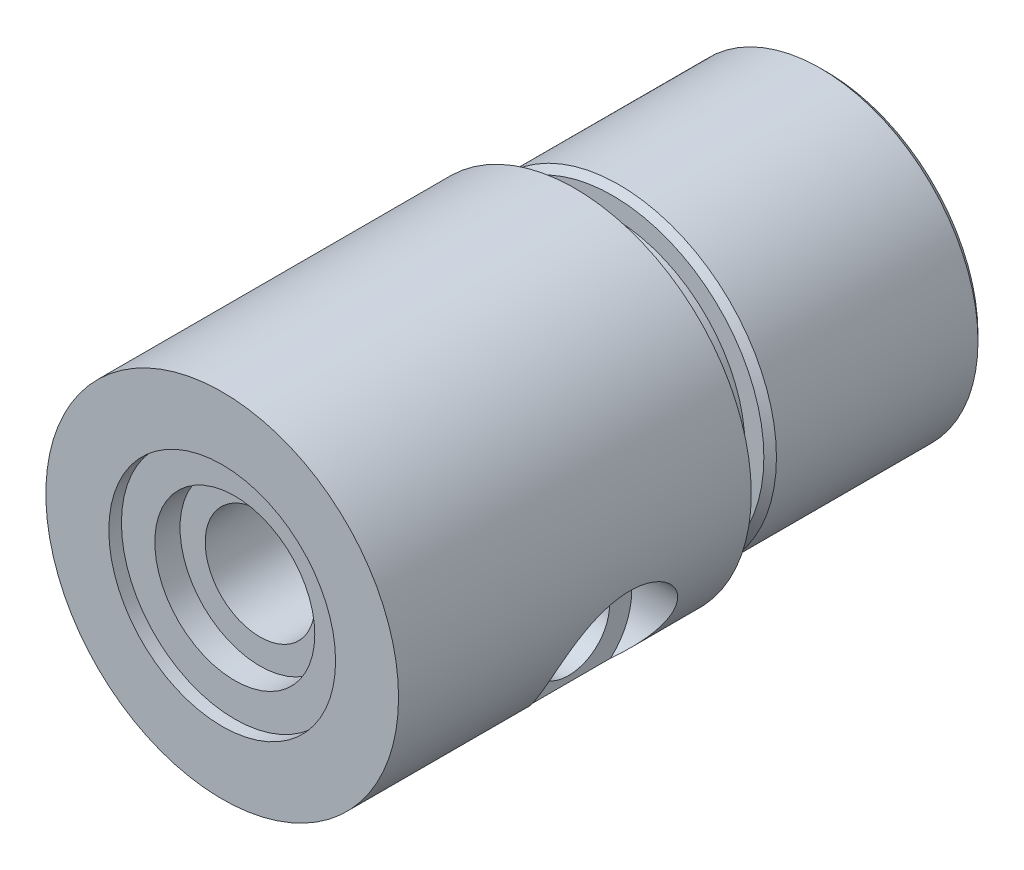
ISO-10303-21;
HEADER;
FILE_DESCRIPTION(('STEP AP214'),'2;1');
FILE_NAME('part.step','',(''),(''),'','','');
FILE_SCHEMA(('AUTOMOTIVE_DESIGN { 1 0 10303 214 1 1 1 1 }'));
ENDSEC;
DATA;
#1=APPLICATION_CONTEXT('core data for automotive mechanical design processes');
#2=APPLICATION_PROTOCOL_DEFINITION('international standard','automotive_design',2000,#1);
#3=PRODUCT_CONTEXT('',#1,'mechanical');
#4=PRODUCT('Part','Part','',(#3));
#5=PRODUCT_RELATED_PRODUCT_CATEGORY('part','',(#4));
#6=PRODUCT_DEFINITION_FORMATION('','',#4);
#7=PRODUCT_DEFINITION_CONTEXT('part definition',#1,'design');
#8=PRODUCT_DEFINITION('design','',#6,#7);
#9=PRODUCT_DEFINITION_SHAPE('','',#8);
#10=(LENGTH_UNIT() NAMED_UNIT(*) SI_UNIT(.MILLI.,.METRE.));
#11=(NAMED_UNIT(*) PLANE_ANGLE_UNIT() SI_UNIT($,.RADIAN.));
#12=(NAMED_UNIT(*) SI_UNIT($,.STERADIAN.) SOLID_ANGLE_UNIT());
#13=UNCERTAINTY_MEASURE_WITH_UNIT(LENGTH_MEASURE(1.E-05),#10,'distance_accuracy_value','');
#14=(GEOMETRIC_REPRESENTATION_CONTEXT(3) GLOBAL_UNCERTAINTY_ASSIGNED_CONTEXT((#13)) GLOBAL_UNIT_ASSIGNED_CONTEXT((#10,
#11,#12)) REPRESENTATION_CONTEXT('',''));
#15=CARTESIAN_POINT('',(0.,0.,0.));
#16=DIRECTION('',(0.,0.,1.));
#17=DIRECTION('',(1.,0.,0.));
#18=AXIS2_PLACEMENT_3D('',#15,#16,#17);
#19=CARTESIAN_POINT('',(0.,0.,48.));
#20=DIRECTION('',(0.,0.,-1.));
#21=DIRECTION('',(-1.,0.,0.));
#22=AXIS2_PLACEMENT_3D('',#19,#20,#21);
#23=CYLINDRICAL_SURFACE('',#22,14.);
#24=CARTESIAN_POINT('',(0.,0.,20.));
#25=DIRECTION('',(0.,0.,1.));
#26=DIRECTION('',(1.,0.,0.));
#27=AXIS2_PLACEMENT_3D('',#24,#25,#26);
#28=CIRCLE('',#27,14.);
#29=CARTESIAN_POINT('',(14.,0.,20.));
#30=VERTEX_POINT('',#29);
#31=EDGE_CURVE('E117',#30,#30,#28,.T.);
#32=ORIENTED_EDGE('',*,*,#31,.T.);
#33=EDGE_LOOP('',(#32));
#34=FACE_BOUND('',#33,.T.);
#35=CARTESIAN_POINT('',(0.,0.,48.));
#36=DIRECTION('',(0.,0.,1.));
#37=DIRECTION('',(1.,0.,0.));
#38=AXIS2_PLACEMENT_3D('',#35,#36,#37);
#39=CIRCLE('',#38,14.);
#40=CARTESIAN_POINT('',(14.,0.,48.));
#41=VERTEX_POINT('',#40);
#42=EDGE_CURVE('E122',#41,#41,#39,.T.);
#43=ORIENTED_EDGE('',*,*,#42,.F.);
#44=EDGE_LOOP('',(#43));
#45=FACE_BOUND('',#44,.T.);
#46=DIRECTION('',(0.,0.,-1.));
#47=VECTOR('',#46,1.);
#48=CARTESIAN_POINT('',(9.,-10.7238052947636,48.));
#49=LINE('',#48,#47);
#50=CARTESIAN_POINT('',(9.,-10.7238052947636,32.8366561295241));
#51=VERTEX_POINT('',#50);
#52=CARTESIAN_POINT('',(9.,-10.7238052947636,26.1633438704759));
#53=VERTEX_POINT('',#52);
#54=EDGE_CURVE('E105',#51,#53,#49,.T.);
#55=ORIENTED_EDGE('',*,*,#54,.F.);
#56=CARTESIAN_POINT('',(9.,-10.7238052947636,32.8366561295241));
#57=CARTESIAN_POINT('',(9.06564268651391,-10.6687159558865,32.8981304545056));
#58=CARTESIAN_POINT('',(9.13163062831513,-10.6123062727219,32.9580293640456));
#59=CARTESIAN_POINT('',(9.2640771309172,-10.4968845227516,33.0747088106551));
#60=CARTESIAN_POINT('',(9.33053566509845,-10.4378726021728,33.1314895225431));
#61=CARTESIAN_POINT('',(9.53032590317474,-10.2569566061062,33.2972358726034));
#62=CARTESIAN_POINT('',(9.66404503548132,-10.131195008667,33.4015804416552));
#63=CARTESIAN_POINT('',(9.93183958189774,-9.86883768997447,33.5983951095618));
#64=CARTESIAN_POINT('',(10.0659112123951,-9.73217396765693,33.6907794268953));
#65=CARTESIAN_POINT('',(10.332155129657,-9.44903792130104,33.8622927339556));
#66=CARTESIAN_POINT('',(10.464327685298,-9.30256700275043,33.9414236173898));
#67=CARTESIAN_POINT('',(10.7135434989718,-9.01404038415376,34.0789498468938));
#68=CARTESIAN_POINT('',(10.8308624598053,-8.87281203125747,34.1385813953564));
#69=CARTESIAN_POINT('',(11.0619813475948,-8.58294318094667,34.2453280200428));
#70=CARTESIAN_POINT('',(11.175781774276,-8.43430374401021,34.2924448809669));
#71=CARTESIAN_POINT('',(11.3986805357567,-8.13052802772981,34.3730420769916));
#72=CARTESIAN_POINT('',(11.5077896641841,-7.97540848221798,34.406555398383));
#73=CARTESIAN_POINT('',(11.720660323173,-7.65914015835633,34.4589527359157));
#74=CARTESIAN_POINT('',(11.8244228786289,-7.49799254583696,34.4778395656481));
#75=CARTESIAN_POINT('',(12.0075174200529,-7.20030035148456,34.4977937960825));
#76=CARTESIAN_POINT('',(12.087880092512,-7.06456108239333,34.5014609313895));
#77=CARTESIAN_POINT('',(12.2438933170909,-6.79057524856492,34.4974897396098));
#78=CARTESIAN_POINT('',(12.3195448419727,-6.65232920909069,34.4898537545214));
#79=CARTESIAN_POINT('',(12.4656853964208,-6.37427288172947,34.4626583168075));
#80=CARTESIAN_POINT('',(12.5361744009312,-6.23446258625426,34.4430988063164));
#81=CARTESIAN_POINT('',(12.6715839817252,-5.95442240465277,34.3915268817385));
#82=CARTESIAN_POINT('',(12.7365044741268,-5.81419251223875,34.3595142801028));
#83=CARTESIAN_POINT('',(12.8608332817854,-5.53377209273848,34.2824102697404));
#84=CARTESIAN_POINT('',(12.9202051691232,-5.39358713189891,34.237239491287));
#85=CARTESIAN_POINT('',(13.032764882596,-5.11561576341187,34.1336908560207));
#86=CARTESIAN_POINT('',(13.085952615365,-4.97782939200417,34.0753127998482));
#87=CARTESIAN_POINT('',(13.1860456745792,-4.70628677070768,33.9453937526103));
#88=CARTESIAN_POINT('',(13.232952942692,-4.57252928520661,33.873856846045));
#89=CARTESIAN_POINT('',(13.3205681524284,-4.3106299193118,33.7178798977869));
#90=CARTESIAN_POINT('',(13.3612767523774,-4.18248744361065,33.6334412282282));
#91=CARTESIAN_POINT('',(13.4326487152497,-3.94682687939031,33.4619477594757));
#92=CARTESIAN_POINT('',(13.4639217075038,-3.83857362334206,33.3761533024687));
#93=CARTESIAN_POINT('',(13.5219489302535,-3.62887479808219,33.1952250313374));
#94=CARTESIAN_POINT('',(13.5487033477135,-3.52742894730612,33.1000916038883));
#95=CARTESIAN_POINT('',(13.5979964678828,-3.3323588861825,32.9011490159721));
#96=CARTESIAN_POINT('',(13.6205359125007,-3.23873330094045,32.7973413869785));
#97=CARTESIAN_POINT('',(13.661760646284,-3.06017886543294,32.5817844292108));
#98=CARTESIAN_POINT('',(13.6804459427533,-2.97524999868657,32.4700351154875));
#99=CARTESIAN_POINT('',(13.7137333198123,-2.8177588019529,32.2435732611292));
#100=CARTESIAN_POINT('',(13.7284578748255,-2.7448620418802,32.1291109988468));
#101=CARTESIAN_POINT('',(13.7550252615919,-2.60846913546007,31.8943458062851));
#102=CARTESIAN_POINT('',(13.7668671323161,-2.5449761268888,31.7740409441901));
#103=CARTESIAN_POINT('',(13.7879867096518,-2.42795357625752,31.5285166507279));
#104=CARTESIAN_POINT('',(13.7972653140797,-2.37442054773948,31.4032989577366));
#105=CARTESIAN_POINT('',(13.8135634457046,-2.27769028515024,31.1487382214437));
#106=CARTESIAN_POINT('',(13.8205821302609,-2.23449690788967,31.0193936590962));
#107=CARTESIAN_POINT('',(13.8326653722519,-2.15844091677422,30.7562788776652));
#108=CARTESIAN_POINT('',(13.8377107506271,-2.12568024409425,30.6224783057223));
#109=CARTESIAN_POINT('',(13.8459563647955,-2.07129188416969,30.3525266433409));
#110=CARTESIAN_POINT('',(13.8491559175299,-2.04966831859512,30.2163747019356));
#111=CARTESIAN_POINT('',(13.8538438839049,-2.01773897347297,29.9427638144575));
#112=CARTESIAN_POINT('',(13.8553328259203,-2.00742969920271,29.8053052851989));
#113=CARTESIAN_POINT('',(13.8566681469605,-1.99819161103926,29.5299477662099));
#114=CARTESIAN_POINT('',(13.8565139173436,-1.99926701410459,29.3920486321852));
#115=CARTESIAN_POINT('',(13.8545461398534,-2.01285842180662,29.1156475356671));
#116=CARTESIAN_POINT('',(13.852718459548,-2.02547186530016,28.9771504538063));
#117=CARTESIAN_POINT('',(13.847300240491,-2.06218810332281,28.7016701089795));
#118=CARTESIAN_POINT('',(13.843709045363,-2.08629517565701,28.5646874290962));
#119=CARTESIAN_POINT('',(13.8346094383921,-2.14580666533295,28.2933122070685));
#120=CARTESIAN_POINT('',(13.8291016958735,-2.1812071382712,28.1589187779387));
#121=CARTESIAN_POINT('',(13.8159451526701,-2.26304586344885,27.8935908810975));
#122=CARTESIAN_POINT('',(13.8082955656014,-2.30948816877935,27.762657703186));
#123=CARTESIAN_POINT('',(13.7905884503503,-2.41296893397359,27.5054261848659));
#124=CARTESIAN_POINT('',(13.7805344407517,-2.46999188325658,27.3791213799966));
#125=CARTESIAN_POINT('',(13.7576927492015,-2.59420037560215,27.1318542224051));
#126=CARTESIAN_POINT('',(13.7449040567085,-2.66138967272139,27.0108938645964));
#127=CARTESIAN_POINT('',(13.7019118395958,-2.87735524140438,26.6575060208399));
#128=CARTESIAN_POINT('',(13.6670623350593,-3.0406576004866,26.4342541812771));
#129=CARTESIAN_POINT('',(13.5826051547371,-3.39794694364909,26.0216411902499));
#130=CARTESIAN_POINT('',(13.5331643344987,-3.59157597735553,25.8319336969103));
#131=CARTESIAN_POINT('',(13.4170008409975,-4.00372500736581,25.4882335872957));
#132=CARTESIAN_POINT('',(13.3502808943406,-4.22224107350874,25.3342353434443));
#133=CARTESIAN_POINT('',(13.1986144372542,-4.67473364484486,25.0658149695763));
#134=CARTESIAN_POINT('',(13.1137697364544,-4.90861893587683,24.9511807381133));
#135=CARTESIAN_POINT('',(12.9255850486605,-5.38467997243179,24.7611733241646));
#136=CARTESIAN_POINT('',(12.8222416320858,-5.62685724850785,24.6858074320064));
#137=CARTESIAN_POINT('',(12.5930988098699,-6.12306264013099,24.5706166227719));
#138=CARTESIAN_POINT('',(12.4664874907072,-6.37712535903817,24.5325782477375));
#139=CARTESIAN_POINT('',(12.1966961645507,-6.8790947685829,24.4951205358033));
#140=CARTESIAN_POINT('',(12.053511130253,-7.1269995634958,24.4957129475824));
#141=CARTESIAN_POINT('',(11.7338854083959,-7.64327948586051,24.5339468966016));
#142=CARTESIAN_POINT('',(11.5555432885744,-7.91010461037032,24.576412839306));
#143=CARTESIAN_POINT('',(11.1855898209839,-8.42515985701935,24.7000826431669));
#144=CARTESIAN_POINT('',(10.9939637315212,-8.67336866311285,24.7813301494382));
#145=CARTESIAN_POINT('',(10.6804171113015,-9.05333979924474,24.9384660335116));
#146=CARTESIAN_POINT('',(10.5612303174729,-9.19201072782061,25.0035300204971));
#147=CARTESIAN_POINT('',(10.3206409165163,-9.46133893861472,25.1451233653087));
#148=CARTESIAN_POINT('',(10.1992386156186,-9.59199731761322,25.2216511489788));
#149=CARTESIAN_POINT('',(9.95530246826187,-9.84493849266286,25.385510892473));
#150=CARTESIAN_POINT('',(9.83276966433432,-9.96722827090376,25.4728336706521));
#151=CARTESIAN_POINT('',(9.58755260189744,-10.203321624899,25.657965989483));
#152=CARTESIAN_POINT('',(9.46486843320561,-10.3171288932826,25.7557709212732));
#153=CARTESIAN_POINT('',(9.28523210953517,-10.4780929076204,25.9072475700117));
#154=CARTESIAN_POINT('',(9.22786455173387,-10.5286390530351,25.9568729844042));
#155=CARTESIAN_POINT('',(9.11357857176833,-10.627718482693,26.0583903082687));
#156=CARTESIAN_POINT('',(9.05665968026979,-10.676254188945,26.1102793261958));
#157=CARTESIAN_POINT('',(8.99999999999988,-10.7238052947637,26.1633438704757));
#158=B_SPLINE_CURVE_WITH_KNOTS('',3,(#56,#57,#58,#59,#60,#61,#62,#63,#64,#65,#66,#67,#68,#69,
#70,#71,#72,#73,#74,#75,#76,#77,#78,#79,#80,#81,#82,#83,#84,#85,#86,#87,#88,#89,#90,#91,#92,#93,
#94,#95,#96,#97,#98,#99,#100,#101,#102,#103,#104,#105,#106,#107,#108,#109,#110,#111,#112,#113,
#114,#115,#116,#117,#118,#119,#120,#121,#122,#123,#124,#125,#126,#127,#128,#129,#130,#131,#132,
#133,#134,#135,#136,#137,#138,#139,#140,#141,#142,#143,#144,#145,#146,#147,#148,#149,#150,#151,
#152,#153,#154,#155,#156,#157),.UNSPECIFIED.,.F.,.F.,(4,2,2,2,2,2,2,2,2,2,2,2,2,2,2,2,2,2,2,2,2,
2,2,2,2,2,2,2,2,2,2,2,2,2,2,2,2,2,2,2,2,2,2,2,2,2,2,2,2,2,4),(0.,0.316349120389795,
0.632680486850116,1.2654734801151,1.90257947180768,2.53959435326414,3.11817894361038,
3.69668097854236,4.27377174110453,4.85075146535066,5.32365633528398,5.79646323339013,
6.26927242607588,6.74208873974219,7.21781831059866,7.69355506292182,8.16914439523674,
8.64468318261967,9.06902572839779,9.493350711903,9.91760093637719,10.3418503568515,
10.7508740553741,11.160033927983,11.5690503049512,11.9782190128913,12.3912711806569,
12.8044761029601,13.2175533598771,13.6307836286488,14.0475361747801,14.4644439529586,
14.8812062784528,15.2981218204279,15.7144309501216,16.1308941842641,16.9628044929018,
17.7855477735,18.6081613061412,19.426270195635,20.2445309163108,21.1002809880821,
21.9562913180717,22.9240013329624,23.8928029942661,24.4745970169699,25.0563112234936,
25.6375340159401,26.2185022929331,26.4919138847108,26.7649858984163),.UNSPECIFIED.);
#159=EDGE_CURVE('E167',#51,#53,#158,.T.);
#160=ORIENTED_EDGE('',*,*,#159,.T.);
#161=EDGE_LOOP('',(#55,#160));
#162=FACE_BOUND('',#161,.T.);
#163=CARTESIAN_POINT('',(-9.,-10.7238052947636,32.8366561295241));
#164=CARTESIAN_POINT('',(-9.06564268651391,-10.6687159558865,32.8981304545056));
#165=CARTESIAN_POINT('',(-9.13163062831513,-10.6123062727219,32.9580293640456));
#166=CARTESIAN_POINT('',(-9.2640771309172,-10.4968845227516,33.0747088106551));
#167=CARTESIAN_POINT('',(-9.33053566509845,-10.4378726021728,33.1314895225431));
#168=CARTESIAN_POINT('',(-9.53032590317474,-10.2569566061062,33.2972358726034));
#169=CARTESIAN_POINT('',(-9.66404503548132,-10.131195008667,33.4015804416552));
#170=CARTESIAN_POINT('',(-9.93183958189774,-9.86883768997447,33.5983951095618));
#171=CARTESIAN_POINT('',(-10.0659112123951,-9.73217396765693,33.6907794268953));
#172=CARTESIAN_POINT('',(-10.332155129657,-9.44903792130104,33.8622927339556));
#173=CARTESIAN_POINT('',(-10.464327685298,-9.30256700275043,33.9414236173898));
#174=CARTESIAN_POINT('',(-10.7135434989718,-9.01404038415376,34.0789498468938));
#175=CARTESIAN_POINT('',(-10.8308624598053,-8.87281203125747,34.1385813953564));
#176=CARTESIAN_POINT('',(-11.0619813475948,-8.58294318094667,34.2453280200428));
#177=CARTESIAN_POINT('',(-11.175781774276,-8.43430374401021,34.2924448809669));
#178=CARTESIAN_POINT('',(-11.3986805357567,-8.13052802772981,34.3730420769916));
#179=CARTESIAN_POINT('',(-11.5077896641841,-7.97540848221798,34.406555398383));
#180=CARTESIAN_POINT('',(-11.720660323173,-7.65914015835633,34.4589527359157));
#181=CARTESIAN_POINT('',(-11.8244228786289,-7.49799254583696,34.4778395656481));
#182=CARTESIAN_POINT('',(-12.0075174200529,-7.20030035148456,34.4977937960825));
#183=CARTESIAN_POINT('',(-12.087880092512,-7.06456108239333,34.5014609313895));
#184=CARTESIAN_POINT('',(-12.2438933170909,-6.79057524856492,34.4974897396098));
#185=CARTESIAN_POINT('',(-12.3195448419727,-6.65232920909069,34.4898537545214));
#186=CARTESIAN_POINT('',(-12.4656853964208,-6.37427288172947,34.4626583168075));
#187=CARTESIAN_POINT('',(-12.5361744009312,-6.23446258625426,34.4430988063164));
#188=CARTESIAN_POINT('',(-12.6715839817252,-5.95442240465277,34.3915268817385));
#189=CARTESIAN_POINT('',(-12.7365044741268,-5.81419251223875,34.3595142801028));
#190=CARTESIAN_POINT('',(-12.8608332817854,-5.53377209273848,34.2824102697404));
#191=CARTESIAN_POINT('',(-12.9202051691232,-5.39358713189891,34.237239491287));
#192=CARTESIAN_POINT('',(-13.032764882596,-5.11561576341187,34.1336908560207));
#193=CARTESIAN_POINT('',(-13.085952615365,-4.97782939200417,34.0753127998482));
#194=CARTESIAN_POINT('',(-13.1860456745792,-4.70628677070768,33.9453937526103));
#195=CARTESIAN_POINT('',(-13.232952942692,-4.57252928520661,33.873856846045));
#196=CARTESIAN_POINT('',(-13.3205681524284,-4.3106299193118,33.7178798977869));
#197=CARTESIAN_POINT('',(-13.3612767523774,-4.18248744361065,33.6334412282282));
#198=CARTESIAN_POINT('',(-13.4326487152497,-3.94682687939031,33.4619477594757));
#199=CARTESIAN_POINT('',(-13.4639217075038,-3.83857362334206,33.3761533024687));
#200=CARTESIAN_POINT('',(-13.5219489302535,-3.62887479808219,33.1952250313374));
#201=CARTESIAN_POINT('',(-13.5487033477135,-3.52742894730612,33.1000916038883));
#202=CARTESIAN_POINT('',(-13.5979964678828,-3.3323588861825,32.9011490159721));
#203=CARTESIAN_POINT('',(-13.6205359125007,-3.23873330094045,32.7973413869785));
#204=CARTESIAN_POINT('',(-13.661760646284,-3.06017886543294,32.5817844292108));
#205=CARTESIAN_POINT('',(-13.6804459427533,-2.97524999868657,32.4700351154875));
#206=CARTESIAN_POINT('',(-13.7137333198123,-2.8177588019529,32.2435732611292));
#207=CARTESIAN_POINT('',(-13.7284578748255,-2.7448620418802,32.1291109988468));
#208=CARTESIAN_POINT('',(-13.7550252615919,-2.60846913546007,31.8943458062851));
#209=CARTESIAN_POINT('',(-13.7668671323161,-2.5449761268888,31.7740409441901));
#210=CARTESIAN_POINT('',(-13.7879867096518,-2.42795357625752,31.5285166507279));
#211=CARTESIAN_POINT('',(-13.7972653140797,-2.37442054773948,31.4032989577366));
#212=CARTESIAN_POINT('',(-13.8135634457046,-2.27769028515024,31.1487382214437));
#213=CARTESIAN_POINT('',(-13.8205821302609,-2.23449690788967,31.0193936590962));
#214=CARTESIAN_POINT('',(-13.8326653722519,-2.15844091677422,30.7562788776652));
#215=CARTESIAN_POINT('',(-13.8377107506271,-2.12568024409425,30.6224783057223));
#216=CARTESIAN_POINT('',(-13.8459563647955,-2.07129188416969,30.3525266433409));
#217=CARTESIAN_POINT('',(-13.8491559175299,-2.04966831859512,30.2163747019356));
#218=CARTESIAN_POINT('',(-13.8538438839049,-2.01773897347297,29.9427638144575));
#219=CARTESIAN_POINT('',(-13.8553328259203,-2.00742969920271,29.8053052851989));
#220=CARTESIAN_POINT('',(-13.8566681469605,-1.99819161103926,29.5299477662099));
#221=CARTESIAN_POINT('',(-13.8565139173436,-1.99926701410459,29.3920486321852));
#222=CARTESIAN_POINT('',(-13.8545461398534,-2.01285842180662,29.1156475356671));
#223=CARTESIAN_POINT('',(-13.852718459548,-2.02547186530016,28.9771504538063));
#224=CARTESIAN_POINT('',(-13.847300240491,-2.06218810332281,28.7016701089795));
#225=CARTESIAN_POINT('',(-13.843709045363,-2.08629517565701,28.5646874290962));
#226=CARTESIAN_POINT('',(-13.8346094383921,-2.14580666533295,28.2933122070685));
#227=CARTESIAN_POINT('',(-13.8291016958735,-2.1812071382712,28.1589187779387));
#228=CARTESIAN_POINT('',(-13.8159451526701,-2.26304586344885,27.8935908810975));
#229=CARTESIAN_POINT('',(-13.8082955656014,-2.30948816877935,27.762657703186));
#230=CARTESIAN_POINT('',(-13.7905884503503,-2.41296893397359,27.5054261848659));
#231=CARTESIAN_POINT('',(-13.7805344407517,-2.46999188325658,27.3791213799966));
#232=CARTESIAN_POINT('',(-13.7576927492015,-2.59420037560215,27.1318542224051));
#233=CARTESIAN_POINT('',(-13.7449040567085,-2.66138967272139,27.0108938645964));
#234=CARTESIAN_POINT('',(-13.7019118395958,-2.87735524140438,26.6575060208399));
#235=CARTESIAN_POINT('',(-13.6670623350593,-3.0406576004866,26.4342541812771));
#236=CARTESIAN_POINT('',(-13.5826051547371,-3.39794694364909,26.0216411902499));
#237=CARTESIAN_POINT('',(-13.5331643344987,-3.59157597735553,25.8319336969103));
#238=CARTESIAN_POINT('',(-13.4170008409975,-4.00372500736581,25.4882335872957));
#239=CARTESIAN_POINT('',(-13.3502808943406,-4.22224107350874,25.3342353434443));
#240=CARTESIAN_POINT('',(-13.1986144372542,-4.67473364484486,25.0658149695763));
#241=CARTESIAN_POINT('',(-13.1137697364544,-4.90861893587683,24.9511807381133));
#242=CARTESIAN_POINT('',(-12.9255850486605,-5.38467997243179,24.7611733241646));
#243=CARTESIAN_POINT('',(-12.8222416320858,-5.62685724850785,24.6858074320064));
#244=CARTESIAN_POINT('',(-12.5930988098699,-6.12306264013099,24.5706166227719));
#245=CARTESIAN_POINT('',(-12.4664874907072,-6.37712535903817,24.5325782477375));
#246=CARTESIAN_POINT('',(-12.1966961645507,-6.8790947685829,24.4951205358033));
#247=CARTESIAN_POINT('',(-12.053511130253,-7.1269995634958,24.4957129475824));
#248=CARTESIAN_POINT('',(-11.7338854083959,-7.64327948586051,24.5339468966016));
#249=CARTESIAN_POINT('',(-11.5555432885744,-7.91010461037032,24.576412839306));
#250=CARTESIAN_POINT('',(-11.1855898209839,-8.42515985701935,24.7000826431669));
#251=CARTESIAN_POINT('',(-10.9939637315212,-8.67336866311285,24.7813301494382));
#252=CARTESIAN_POINT('',(-10.6804171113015,-9.05333979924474,24.9384660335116));
#253=CARTESIAN_POINT('',(-10.5612303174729,-9.19201072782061,25.0035300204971));
#254=CARTESIAN_POINT('',(-10.3206409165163,-9.46133893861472,25.1451233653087));
#255=CARTESIAN_POINT('',(-10.1992386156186,-9.59199731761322,25.2216511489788));
#256=CARTESIAN_POINT('',(-9.95530246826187,-9.84493849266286,25.385510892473));
#257=CARTESIAN_POINT('',(-9.83276966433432,-9.96722827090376,25.4728336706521));
#258=CARTESIAN_POINT('',(-9.58755260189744,-10.203321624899,25.657965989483));
#259=CARTESIAN_POINT('',(-9.46486843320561,-10.3171288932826,25.7557709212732));
#260=CARTESIAN_POINT('',(-9.28523210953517,-10.4780929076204,25.9072475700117));
#261=CARTESIAN_POINT('',(-9.22786455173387,-10.5286390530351,25.9568729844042));
#262=CARTESIAN_POINT('',(-9.11357857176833,-10.627718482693,26.0583903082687));
#263=CARTESIAN_POINT('',(-9.05665968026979,-10.676254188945,26.1102793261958));
#264=CARTESIAN_POINT('',(-8.99999999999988,-10.7238052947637,26.1633438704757));
#265=B_SPLINE_CURVE_WITH_KNOTS('',3,(#163,#164,#165,#166,#167,#168,#169,#170,#171,#172,#173,
#174,#175,#176,#177,#178,#179,#180,#181,#182,#183,#184,#185,#186,#187,#188,#189,#190,#191,#192,
#193,#194,#195,#196,#197,#198,#199,#200,#201,#202,#203,#204,#205,#206,#207,#208,#209,#210,#211,
#212,#213,#214,#215,#216,#217,#218,#219,#220,#221,#222,#223,#224,#225,#226,#227,#228,#229,#230,
#231,#232,#233,#234,#235,#236,#237,#238,#239,#240,#241,#242,#243,#244,#245,#246,#247,#248,#249,
#250,#251,#252,#253,#254,#255,#256,#257,#258,#259,#260,#261,#262,#263,#264),.UNSPECIFIED.,.F.,
.F.,(4,2,2,2,2,2,2,2,2,2,2,2,2,2,2,2,2,2,2,2,2,2,2,2,2,2,2,2,2,2,2,2,2,2,2,2,2,2,2,2,2,2,2,2,2,
2,2,2,2,2,4),(0.,0.316349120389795,0.632680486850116,1.2654734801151,1.90257947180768,
2.53959435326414,3.11817894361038,3.69668097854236,4.27377174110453,4.85075146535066,
5.32365633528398,5.79646323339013,6.26927242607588,6.74208873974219,7.21781831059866,
7.69355506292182,8.16914439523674,8.64468318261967,9.06902572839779,9.493350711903,
9.91760093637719,10.3418503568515,10.7508740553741,11.160033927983,11.5690503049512,
11.9782190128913,12.3912711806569,12.8044761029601,13.2175533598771,13.6307836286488,
14.0475361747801,14.4644439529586,14.8812062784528,15.2981218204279,15.7144309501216,
16.1308941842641,16.9628044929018,17.7855477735,18.6081613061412,19.426270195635,
20.2445309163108,21.1002809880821,21.9562913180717,22.9240013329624,23.8928029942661,
24.4745970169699,25.0563112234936,25.6375340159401,26.2185022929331,26.4919138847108,
26.7649858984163),.UNSPECIFIED.);
#266=CARTESIAN_POINT('',(-9.,-10.7238052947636,32.8366561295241));
#267=VERTEX_POINT('',#266);
#268=CARTESIAN_POINT('',(-9.,-10.7238052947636,26.1633438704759));
#269=VERTEX_POINT('',#268);
#270=EDGE_CURVE('E11',#267,#269,#265,.T.);
#271=ORIENTED_EDGE('',*,*,#270,.F.);
#272=DIRECTION('',(0.,0.,-1.));
#273=VECTOR('',#272,1.);
#274=CARTESIAN_POINT('',(-9.,-10.7238052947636,48.));
#275=LINE('',#274,#273);
#276=EDGE_CURVE('E46',#267,#269,#275,.T.);
#277=ORIENTED_EDGE('',*,*,#276,.T.);
#278=EDGE_LOOP('',(#271,#277));
#279=FACE_BOUND('',#278,.T.);
#280=ADVANCED_FACE('F33',(#34,#45,#162,#279),#23,.T.);
#281=CARTESIAN_POINT('',(-14.,-7.,29.5));
#282=DIRECTION('',(1.,0.,0.));
#283=DIRECTION('',(0.,0.,-1.));
#284=AXIS2_PLACEMENT_3D('',#281,#282,#283);
#285=CYLINDRICAL_SURFACE('',#284,3.25);
#286=CARTESIAN_POINT('',(-9.,-7.,29.5));
#287=DIRECTION('',(1.,0.,0.));
#288=DIRECTION('',(0.,0.,-1.));
#289=AXIS2_PLACEMENT_3D('',#286,#287,#288);
#290=CIRCLE('',#289,3.25);
#291=CARTESIAN_POINT('',(-9.,-7.,26.25));
#292=VERTEX_POINT('',#291);
#293=EDGE_CURVE('E100',#292,#292,#290,.F.);
#294=ORIENTED_EDGE('',*,*,#293,.T.);
#295=EDGE_LOOP('',(#294));
#296=FACE_BOUND('',#295,.T.);
#297=CARTESIAN_POINT('',(-0.5,-5.23092092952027,26.773672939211));
#298=CARTESIAN_POINT('',(-0.499999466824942,-5.19529760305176,26.796790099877));
#299=CARTESIAN_POINT('',(-0.496191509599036,-5.16010303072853,26.8206295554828));
#300=CARTESIAN_POINT('',(-0.481483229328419,-5.09161475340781,26.8689674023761));
#301=CARTESIAN_POINT('',(-0.470564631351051,-5.05832618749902,26.8934673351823));
#302=CARTESIAN_POINT('',(-0.442515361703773,-4.99573321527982,26.941307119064));
#303=CARTESIAN_POINT('',(-0.425627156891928,-4.96632747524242,26.9646565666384));
#304=CARTESIAN_POINT('',(-0.385711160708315,-4.91093749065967,27.0101015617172));
#305=CARTESIAN_POINT('',(-0.362695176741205,-4.88494680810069,27.0321994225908));
#306=CARTESIAN_POINT('',(-0.318376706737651,-4.84460087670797,27.0674613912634));
#307=CARTESIAN_POINT('',(-0.298654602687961,-4.8291017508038,27.081308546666));
#308=CARTESIAN_POINT('',(-0.256205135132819,-4.8007961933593,27.1070173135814));
#309=CARTESIAN_POINT('',(-0.233482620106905,-4.78798550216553,27.1188820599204));
#310=CARTESIAN_POINT('',(-0.190159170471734,-4.76801026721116,27.137613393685));
#311=CARTESIAN_POINT('',(-0.170073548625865,-4.76022689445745,27.1450058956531));
#312=CARTESIAN_POINT('',(-0.128403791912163,-4.74719824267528,27.1574659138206));
#313=CARTESIAN_POINT('',(-0.106820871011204,-4.74195093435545,27.1625352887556));
#314=CARTESIAN_POINT('',(-0.0625186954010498,-4.73433315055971,27.1699177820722));
#315=CARTESIAN_POINT('',(-0.0397925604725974,-4.7319830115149,27.1722114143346));
#316=CARTESIAN_POINT('',(0.00586669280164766,-4.73043449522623,27.173720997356));
#317=CARTESIAN_POINT('',(0.0287997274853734,-4.73123489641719,27.1729381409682));
#318=CARTESIAN_POINT('',(0.0715494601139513,-4.73565170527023,27.1686411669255));
#319=CARTESIAN_POINT('',(0.0914324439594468,-4.73895019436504,27.1654354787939));
#320=CARTESIAN_POINT('',(0.130227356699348,-4.74776760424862,27.1569279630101));
#321=CARTESIAN_POINT('',(0.149138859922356,-4.75328748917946,27.1516252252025));
#322=CARTESIAN_POINT('',(0.191629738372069,-4.76838601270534,27.1372602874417));
#323=CARTESIAN_POINT('',(0.21472295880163,-4.77870105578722,27.127536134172));
#324=CARTESIAN_POINT('',(0.258312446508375,-4.80209737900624,27.1058447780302));
#325=CARTESIAN_POINT('',(0.278803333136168,-4.81518424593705,27.0938730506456));
#326=CARTESIAN_POINT('',(0.323291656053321,-4.84819582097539,27.0642508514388));
#327=CARTESIAN_POINT('',(0.346274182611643,-4.86896218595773,27.0460172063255));
#328=CARTESIAN_POINT('',(0.387527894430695,-4.91351635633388,27.0080235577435));
#329=CARTESIAN_POINT('',(0.405795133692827,-4.93730666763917,26.9882622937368));
#330=CARTESIAN_POINT('',(0.437939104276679,-4.98777376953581,26.9476453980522));
#331=CARTESIAN_POINT('',(0.451725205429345,-5.01449705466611,26.9267760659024));
#332=CARTESIAN_POINT('',(0.474310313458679,-5.06990842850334,26.8849564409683));
#333=CARTESIAN_POINT('',(0.483108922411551,-5.09859667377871,26.8640061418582));
#334=CARTESIAN_POINT('',(0.496341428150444,-5.16151675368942,26.819672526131));
#335=CARTESIAN_POINT('',(0.499997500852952,-5.19596445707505,26.7963563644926));
#336=CARTESIAN_POINT('',(0.500002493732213,-5.26577023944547,26.7510590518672));
#337=CARTESIAN_POINT('',(0.496350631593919,-5.30112841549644,26.729078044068));
#338=CARTESIAN_POINT('',(0.48164793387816,-5.36933606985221,26.6884315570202));
#339=CARTESIAN_POINT('',(0.471049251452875,-5.40220985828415,26.6696467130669));
#340=CARTESIAN_POINT('',(0.442619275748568,-5.4660921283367,26.6345243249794));
#341=CARTESIAN_POINT('',(0.424797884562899,-5.49710309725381,26.6181834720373));
#342=CARTESIAN_POINT('',(0.385264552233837,-5.55110683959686,26.5907063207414));
#343=CARTESIAN_POINT('',(0.364530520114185,-5.57460550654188,26.5791572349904));
#344=CARTESIAN_POINT('',(0.318366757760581,-5.61775076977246,26.5584936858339));
#345=CARTESIAN_POINT('',(0.292941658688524,-5.63740112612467,26.5493768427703));
#346=CARTESIAN_POINT('',(0.241855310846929,-5.66943191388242,26.5348089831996));
#347=CARTESIAN_POINT('',(0.216673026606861,-5.68243100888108,26.5290320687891));
#348=CARTESIAN_POINT('',(0.164139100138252,-5.7040632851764,26.5195321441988));
#349=CARTESIAN_POINT('',(0.13678859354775,-5.71269873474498,26.5158080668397));
#350=CARTESIAN_POINT('',(0.0829135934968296,-5.72471238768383,26.5106554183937));
#351=CARTESIAN_POINT('',(0.0564796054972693,-5.72843462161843,26.5090763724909));
#352=CARTESIAN_POINT('',(0.0033123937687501,-5.73161809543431,26.5077248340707));
#353=CARTESIAN_POINT('',(-0.0234207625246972,-5.73108027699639,26.5079519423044));
#354=CARTESIAN_POINT('',(-0.0756771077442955,-5.72583951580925,26.5101801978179));
#355=CARTESIAN_POINT('',(-0.101213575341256,-5.7212475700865,26.512134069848));
#356=CARTESIAN_POINT('',(-0.151096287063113,-5.70824078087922,26.5177344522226));
#357=CARTESIAN_POINT('',(-0.175442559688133,-5.69982602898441,26.5213809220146));
#358=CARTESIAN_POINT('',(-0.222514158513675,-5.67942005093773,26.5303715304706));
#359=CARTESIAN_POINT('',(-0.245222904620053,-5.66739728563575,26.5357306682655));
#360=CARTESIAN_POINT('',(-0.288227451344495,-5.6402759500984,26.5480732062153));
#361=CARTESIAN_POINT('',(-0.308523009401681,-5.62517707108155,26.5550567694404));
#362=CARTESIAN_POINT('',(-0.347116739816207,-5.59173942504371,26.5708946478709));
#363=CARTESIAN_POINT('',(-0.365288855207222,-5.57328790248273,26.5798173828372));
#364=CARTESIAN_POINT('',(-0.39826476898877,-5.53429838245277,26.5991910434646));
#365=CARTESIAN_POINT('',(-0.413067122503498,-5.51375949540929,26.6096426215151));
#366=CARTESIAN_POINT('',(-0.440258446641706,-5.46946499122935,26.6328345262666));
#367=CARTESIAN_POINT('',(-0.452341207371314,-5.44558404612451,26.6456932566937));
#368=CARTESIAN_POINT('',(-0.472383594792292,-5.39689417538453,26.6727527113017));
#369=CARTESIAN_POINT('',(-0.480344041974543,-5.37208543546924,26.6869531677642));
#370=CARTESIAN_POINT('',(-0.49093136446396,-5.32778396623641,26.7131200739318));
#371=CARTESIAN_POINT('',(-0.494354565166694,-5.30834864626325,26.7248720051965));
#372=CARTESIAN_POINT('',(-0.498889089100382,-5.26954080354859,26.7489032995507));
#373=CARTESIAN_POINT('',(-0.500000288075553,-5.2501682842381,26.7611826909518));
#374=CARTESIAN_POINT('',(-0.5,-5.23092092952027,26.773672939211));
#375=B_SPLINE_CURVE_WITH_KNOTS('',3,(#297,#298,#299,#300,#301,#302,#303,#304,#305,#306,#307,
#308,#309,#310,#311,#312,#313,#314,#315,#316,#317,#318,#319,#320,#321,#322,#323,#324,#325,#326,
#327,#328,#329,#330,#331,#332,#333,#334,#335,#336,#337,#338,#339,#340,#341,#342,#343,#344,#345,
#346,#347,#348,#349,#350,#351,#352,#353,#354,#355,#356,#357,#358,#359,#360,#361,#362,#363,#364,
#365,#366,#367,#368,#369,#370,#371,#372,#373,#374),.UNSPECIFIED.,.T.,.F.,(4,2,2,2,2,2,2,2,2,2,2,
2,2,2,2,2,2,2,2,2,2,2,2,2,2,2,2,2,2,2,2,2,2,2,2,2,2,2,4),(0.,0.127308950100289,
0.254946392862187,0.377903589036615,0.500625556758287,0.586298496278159,0.671834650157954,
0.739891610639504,0.807894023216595,0.876371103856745,0.944821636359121,1.00577754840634,
1.06675994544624,1.1476070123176,1.22861860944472,1.33587780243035,1.4432264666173,
1.55262775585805,1.66203777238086,1.78667394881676,1.91132346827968,2.02857248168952,
2.14566129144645,2.24527125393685,2.34478339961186,2.43109157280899,2.51735483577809,
2.59718508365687,2.67699768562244,2.7546906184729,2.8323816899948,2.91077271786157,
2.98917161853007,3.07099682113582,3.15285704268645,3.24157748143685,3.33028025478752,
3.3990618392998,3.46784712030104),.UNSPECIFIED.);
#376=CARTESIAN_POINT('',(-0.5,-5.23092092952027,26.773672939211));
#377=VERTEX_POINT('',#376);
#378=EDGE_CURVE('E121',#377,#377,#375,.T.);
#379=ORIENTED_EDGE('',*,*,#378,.T.);
#380=EDGE_LOOP('',(#379));
#381=FACE_BOUND('',#380,.T.);
#382=CARTESIAN_POINT('',(9.,-7.,29.5));
#383=DIRECTION('',(1.,0.,0.));
#384=DIRECTION('',(0.,0.,-1.));
#385=AXIS2_PLACEMENT_3D('',#382,#383,#384);
#386=CIRCLE('',#385,3.25);
#387=CARTESIAN_POINT('',(9.,-7.,26.25));
#388=VERTEX_POINT('',#387);
#389=EDGE_CURVE('E104',#388,#388,#386,.F.);
#390=ORIENTED_EDGE('',*,*,#389,.F.);
#391=EDGE_LOOP('',(#390));
#392=FACE_BOUND('',#391,.T.);
#393=ADVANCED_FACE('F141',(#296,#381,#392),#285,.F.);
#394=CARTESIAN_POINT('',(0.,0.,17.));
#395=DIRECTION('',(0.,0.,1.));
#396=DIRECTION('',(1.,0.,0.));
#397=AXIS2_PLACEMENT_3D('',#394,#395,#396);
#398=PLANE('',#397);
#399=CARTESIAN_POINT('',(0.,0.,17.));
#400=DIRECTION('',(0.,0.,1.));
#401=DIRECTION('',(1.,0.,0.));
#402=AXIS2_PLACEMENT_3D('',#399,#400,#401);
#403=CIRCLE('',#402,12.);
#404=CARTESIAN_POINT('',(12.,0.,17.));
#405=VERTEX_POINT('',#404);
#406=EDGE_CURVE('E440',#405,#405,#403,.T.);
#407=ORIENTED_EDGE('',*,*,#406,.T.);
#408=EDGE_LOOP('',(#407));
#409=FACE_BOUND('',#408,.T.);
#410=CARTESIAN_POINT('',(0.,0.,17.));
#411=DIRECTION('',(0.,0.,1.));
#412=DIRECTION('',(1.,0.,0.));
#413=AXIS2_PLACEMENT_3D('',#410,#411,#412);
#414=CIRCLE('',#413,10.5);
#415=CARTESIAN_POINT('',(10.5,0.,17.));
#416=VERTEX_POINT('',#415);
#417=EDGE_CURVE('E125',#416,#416,#414,.T.);
#418=ORIENTED_EDGE('',*,*,#417,.F.);
#419=EDGE_LOOP('',(#418));
#420=FACE_BOUND('',#419,.T.);
#421=ADVANCED_FACE('F248',(#409,#420),#398,.T.);
#422=CARTESIAN_POINT('',(0.,0.,17.));
#423=DIRECTION('',(0.,0.,-1.));
#424=DIRECTION('',(-1.,0.,0.));
#425=AXIS2_PLACEMENT_3D('',#422,#423,#424);
#426=CYLINDRICAL_SURFACE('',#425,12.5);
#427=CARTESIAN_POINT('',(0.,0.,16.5));
#428=DIRECTION('',(0.,0.,1.));
#429=DIRECTION('',(1.,0.,0.));
#430=AXIS2_PLACEMENT_3D('',#427,#428,#429);
#431=CIRCLE('',#430,12.5);
#432=CARTESIAN_POINT('',(12.5,0.,16.5));
#433=VERTEX_POINT('',#432);
#434=EDGE_CURVE('E175',#433,#433,#431,.F.);
#435=ORIENTED_EDGE('',*,*,#434,.T.);
#436=EDGE_LOOP('',(#435));
#437=FACE_BOUND('',#436,.T.);
#438=CARTESIAN_POINT('',(0.,0.,0.500000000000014));
#439=DIRECTION('',(0.,0.,1.));
#440=DIRECTION('',(1.,0.,0.));
#441=AXIS2_PLACEMENT_3D('',#438,#439,#440);
#442=CIRCLE('',#441,12.5);
#443=CARTESIAN_POINT('',(12.5,0.,0.500000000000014));
#444=VERTEX_POINT('',#443);
#445=EDGE_CURVE('E131',#444,#444,#442,.T.);
#446=ORIENTED_EDGE('',*,*,#445,.T.);
#447=EDGE_LOOP('',(#446));
#448=FACE_BOUND('',#447,.T.);
#449=ADVANCED_FACE('F401',(#437,#448),#426,.T.);
#450=CARTESIAN_POINT('',(0.,0.,0.));
#451=DIRECTION('',(0.,0.,1.));
#452=DIRECTION('',(1.,0.,0.));
#453=AXIS2_PLACEMENT_3D('',#450,#451,#452);
#454=PLANE('',#453);
#455=CARTESIAN_POINT('',(0.,0.,0.));
#456=DIRECTION('',(0.,0.,1.));
#457=DIRECTION('',(1.,0.,0.));
#458=AXIS2_PLACEMENT_3D('',#455,#456,#457);
#459=CIRCLE('',#458,12.);
#460=CARTESIAN_POINT('',(12.,0.,0.));
#461=VERTEX_POINT('',#460);
#462=EDGE_CURVE('E438',#461,#461,#459,.F.);
#463=ORIENTED_EDGE('',*,*,#462,.T.);
#464=EDGE_LOOP('',(#463));
#465=FACE_BOUND('',#464,.T.);
#466=CARTESIAN_POINT('',(0.,0.,0.));
#467=DIRECTION('',(0.,0.,-1.));
#468=DIRECTION('',(-1.,0.,0.));
#469=AXIS2_PLACEMENT_3D('',#466,#467,#468);
#470=CIRCLE('',#469,8.);
#471=CARTESIAN_POINT('',(-8.,0.,0.));
#472=VERTEX_POINT('',#471);
#473=EDGE_CURVE('E118',#472,#472,#470,.T.);
#474=ORIENTED_EDGE('',*,*,#473,.F.);
#475=EDGE_LOOP('',(#474));
#476=FACE_BOUND('',#475,.T.);
#477=ADVANCED_FACE('F394',(#465,#476),#454,.F.);
#478=CARTESIAN_POINT('',(0.,0.,20.));
#479=DIRECTION('',(0.,0.,-1.));
#480=DIRECTION('',(-1.,0.,0.));
#481=AXIS2_PLACEMENT_3D('',#478,#479,#480);
#482=CYLINDRICAL_SURFACE('',#481,10.5);
#483=CARTESIAN_POINT('',(0.,0.,20.));
#484=DIRECTION('',(0.,0.,1.));
#485=DIRECTION('',(1.,0.,0.));
#486=AXIS2_PLACEMENT_3D('',#483,#484,#485);
#487=CIRCLE('',#486,10.5);
#488=CARTESIAN_POINT('',(10.5,0.,20.));
#489=VERTEX_POINT('',#488);
#490=EDGE_CURVE('E128',#489,#489,#487,.T.);
#491=ORIENTED_EDGE('',*,*,#490,.F.);
#492=EDGE_LOOP('',(#491));
#493=FACE_BOUND('',#492,.T.);
#494=ORIENTED_EDGE('',*,*,#417,.T.);
#495=EDGE_LOOP('',(#494));
#496=FACE_BOUND('',#495,.T.);
#497=ADVANCED_FACE('F184',(#493,#496),#482,.T.);
#498=CARTESIAN_POINT('',(0.,0.,20.));
#499=DIRECTION('',(0.,0.,1.));
#500=DIRECTION('',(1.,0.,0.));
#501=AXIS2_PLACEMENT_3D('',#498,#499,#500);
#502=PLANE('',#501);
#503=ORIENTED_EDGE('',*,*,#31,.F.);
#504=EDGE_LOOP('',(#503));
#505=FACE_BOUND('',#504,.T.);
#506=ORIENTED_EDGE('',*,*,#490,.T.);
#507=EDGE_LOOP('',(#506));
#508=FACE_BOUND('',#507,.T.);
#509=ADVANCED_FACE('F182',(#505,#508),#502,.F.);
#510=CARTESIAN_POINT('',(0.,0.,48.));
#511=DIRECTION('',(0.,0.,1.));
#512=DIRECTION('',(1.,0.,0.));
#513=AXIS2_PLACEMENT_3D('',#510,#511,#512);
#514=PLANE('',#513);
#515=CARTESIAN_POINT('',(0.,0.,48.));
#516=DIRECTION('',(0.,0.,1.));
#517=DIRECTION('',(1.,0.,0.));
#518=AXIS2_PLACEMENT_3D('',#515,#516,#517);
#519=CIRCLE('',#518,9.);
#520=CARTESIAN_POINT('',(9.,0.,48.));
#521=VERTEX_POINT('',#520);
#522=EDGE_CURVE('E93',#521,#521,#519,.T.);
#523=ORIENTED_EDGE('',*,*,#522,.F.);
#524=EDGE_LOOP('',(#523));
#525=FACE_BOUND('',#524,.T.);
#526=ORIENTED_EDGE('',*,*,#42,.T.);
#527=EDGE_LOOP('',(#526));
#528=FACE_BOUND('',#527,.T.);
#529=ADVANCED_FACE('F232',(#525,#528),#514,.T.);
#530=CARTESIAN_POINT('',(0.,0.,20.));
#531=DIRECTION('',(0.,0.,-1.));
#532=DIRECTION('',(-1.,0.,0.));
#533=AXIS2_PLACEMENT_3D('',#530,#531,#532);
#534=CYLINDRICAL_SURFACE('',#533,8.);
#535=CARTESIAN_POINT('',(0.,0.,20.));
#536=DIRECTION('',(0.,0.,-1.));
#537=DIRECTION('',(-1.,0.,0.));
#538=AXIS2_PLACEMENT_3D('',#535,#536,#537);
#539=CIRCLE('',#538,8.);
#540=CARTESIAN_POINT('',(-8.,0.,20.));
#541=VERTEX_POINT('',#540);
#542=EDGE_CURVE('E114',#541,#541,#539,.T.);
#543=ORIENTED_EDGE('',*,*,#542,.F.);
#544=EDGE_LOOP('',(#543));
#545=FACE_BOUND('',#544,.T.);
#546=ORIENTED_EDGE('',*,*,#473,.T.);
#547=EDGE_LOOP('',(#546));
#548=FACE_BOUND('',#547,.T.);
#549=ADVANCED_FACE('F235',(#545,#548),#534,.F.);
#550=CARTESIAN_POINT('',(0.,0.,20.));
#551=DIRECTION('',(0.,0.,-1.));
#552=DIRECTION('',(-1.,0.,0.));
#553=AXIS2_PLACEMENT_3D('',#550,#551,#552);
#554=PLANE('',#553);
#555=CARTESIAN_POINT('',(0.,2.5,20.));
#556=DIRECTION('',(0.,0.,-1.));
#557=DIRECTION('',(-1.,0.,0.));
#558=AXIS2_PLACEMENT_3D('',#555,#556,#557);
#559=CIRCLE('',#558,0.5);
#560=CARTESIAN_POINT('',(-0.5,2.5,20.));
#561=VERTEX_POINT('',#560);
#562=EDGE_CURVE('E89',#561,#561,#559,.T.);
#563=ORIENTED_EDGE('',*,*,#562,.F.);
#564=EDGE_LOOP('',(#563));
#565=FACE_BOUND('',#564,.T.);
#566=CARTESIAN_POINT('',(0.,-5.23092093,20.));
#567=DIRECTION('',(0.,0.,-1.));
#568=DIRECTION('',(-1.,0.,0.));
#569=AXIS2_PLACEMENT_3D('',#566,#567,#568);
#570=CIRCLE('',#569,1.69999999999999);
#571=CARTESIAN_POINT('',(-1.69999999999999,-5.23092093,20.));
#572=VERTEX_POINT('',#571);
#573=EDGE_CURVE('E107',#572,#572,#570,.T.);
#574=ORIENTED_EDGE('',*,*,#573,.F.);
#575=EDGE_LOOP('',(#574));
#576=FACE_BOUND('',#575,.T.);
#577=ORIENTED_EDGE('',*,*,#542,.T.);
#578=EDGE_LOOP('',(#577));
#579=FACE_BOUND('',#578,.T.);
#580=ADVANCED_FACE('F149',(#565,#576,#579),#554,.T.);
#581=CARTESIAN_POINT('',(0.,-5.23092092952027,28.));
#582=DIRECTION('',(0.,0.,-1.));
#583=DIRECTION('',(-1.,0.,0.));
#584=AXIS2_PLACEMENT_3D('',#581,#582,#583);
#585=CYLINDRICAL_SURFACE('',#584,0.5);
#586=CARTESIAN_POINT('',(0.,-5.23092093,25.7210327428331));
#587=DIRECTION('',(0.,0.,-1.));
#588=DIRECTION('',(-1.,0.,0.));
#589=AXIS2_PLACEMENT_3D('',#586,#587,#588);
#590=CIRCLE('',#589,0.5);
#591=CARTESIAN_POINT('',(-0.499999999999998,-5.23092093,25.7210327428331));
#592=VERTEX_POINT('',#591);
#593=EDGE_CURVE('E113',#592,#592,#590,.T.);
#594=ORIENTED_EDGE('',*,*,#593,.T.);
#595=EDGE_LOOP('',(#594));
#596=FACE_BOUND('',#595,.T.);
#597=ORIENTED_EDGE('',*,*,#378,.F.);
#598=EDGE_LOOP('',(#597));
#599=FACE_BOUND('',#598,.T.);
#600=ADVANCED_FACE('F144',(#596,#599),#585,.F.);
#601=CARTESIAN_POINT('',(0.,-5.23092093,25.));
#602=DIRECTION('',(0.,0.,-1.));
#603=DIRECTION('',(-1.,0.,0.));
#604=AXIS2_PLACEMENT_3D('',#601,#602,#603);
#605=CONICAL_SURFACE('',#604,1.7,1.02974425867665);
#606=CARTESIAN_POINT('',(0.,-5.23092093,25.));
#607=DIRECTION('',(0.,0.,-1.));
#608=DIRECTION('',(-1.,0.,0.));
#609=AXIS2_PLACEMENT_3D('',#606,#607,#608);
#610=CIRCLE('',#609,1.7);
#611=CARTESIAN_POINT('',(-1.7,-5.23092093,25.));
#612=VERTEX_POINT('',#611);
#613=EDGE_CURVE('E110',#612,#612,#610,.T.);
#614=CARTESIAN_POINT('',(-1.7,-5.23092093,25.));
#615=CARTESIAN_POINT('',(-1.6875,-5.23092093,25.0075107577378));
#616=CARTESIAN_POINT('',(-1.675,-5.23092093,25.0150215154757));
#617=CARTESIAN_POINT('',(-1.65,-5.23092093,25.0300430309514));
#618=CARTESIAN_POINT('',(-1.6375,-5.23092093,25.0375537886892));
#619=CARTESIAN_POINT('',(-1.6125,-5.23092093,25.0525753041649));
#620=CARTESIAN_POINT('',(-1.6,-5.23092093,25.0600860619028));
#621=CARTESIAN_POINT('',(-1.575,-5.23092093,25.0751075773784));
#622=CARTESIAN_POINT('',(-1.5625,-5.23092093,25.0826183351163));
#623=CARTESIAN_POINT('',(-1.5375,-5.23092093,25.097639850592));
#624=CARTESIAN_POINT('',(-1.525,-5.23092093,25.1051506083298));
#625=CARTESIAN_POINT('',(-1.5,-5.23092093,25.1201721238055));
#626=CARTESIAN_POINT('',(-1.4875,-5.23092093,25.1276828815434));
#627=CARTESIAN_POINT('',(-1.4625,-5.23092093,25.142704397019));
#628=CARTESIAN_POINT('',(-1.45,-5.23092093,25.1502151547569));
#629=CARTESIAN_POINT('',(-1.425,-5.23092093,25.1652366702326));
#630=CARTESIAN_POINT('',(-1.4125,-5.23092093,25.1727474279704));
#631=CARTESIAN_POINT('',(-1.3875,-5.23092093,25.1877689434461));
#632=CARTESIAN_POINT('',(-1.375,-5.23092093,25.195279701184));
#633=CARTESIAN_POINT('',(-1.35,-5.23092093,25.2103012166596));
#634=CARTESIAN_POINT('',(-1.3375,-5.23092093,25.2178119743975));
#635=CARTESIAN_POINT('',(-1.3125,-5.23092093,25.2328334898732));
#636=CARTESIAN_POINT('',(-1.3,-5.23092093,25.240344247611));
#637=CARTESIAN_POINT('',(-1.275,-5.23092093,25.2553657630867));
#638=CARTESIAN_POINT('',(-1.2625,-5.23092093,25.2628765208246));
#639=CARTESIAN_POINT('',(-1.2375,-5.23092093,25.2778980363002));
#640=CARTESIAN_POINT('',(-1.225,-5.23092093,25.2854087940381));
#641=CARTESIAN_POINT('',(-1.2,-5.23092093,25.3004303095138));
#642=CARTESIAN_POINT('',(-1.1875,-5.23092093,25.3079410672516));
#643=CARTESIAN_POINT('',(-1.1625,-5.23092093,25.3229625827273));
#644=CARTESIAN_POINT('',(-1.15,-5.23092093,25.3304733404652));
#645=CARTESIAN_POINT('',(-1.125,-5.23092093,25.3454948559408));
#646=CARTESIAN_POINT('',(-1.1125,-5.23092093,25.3530056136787));
#647=CARTESIAN_POINT('',(-1.0875,-5.23092093,25.3680271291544));
#648=CARTESIAN_POINT('',(-1.075,-5.23092093,25.3755378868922));
#649=CARTESIAN_POINT('',(-1.05,-5.23092093,25.3905594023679));
#650=CARTESIAN_POINT('',(-1.0375,-5.23092093,25.3980701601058));
#651=CARTESIAN_POINT('',(-1.0125,-5.23092093,25.4130916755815));
#652=CARTESIAN_POINT('',(-0.999999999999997,-5.23092093,25.4206024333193));
#653=CARTESIAN_POINT('',(-0.974999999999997,-5.23092093,25.435623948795));
#654=CARTESIAN_POINT('',(-0.962499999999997,-5.23092093,25.4431347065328));
#655=CARTESIAN_POINT('',(-0.937499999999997,-5.23092093,25.4581562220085));
#656=CARTESIAN_POINT('',(-0.924999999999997,-5.23092093,25.4656669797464));
#657=CARTESIAN_POINT('',(-0.899999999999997,-5.23092093,25.4806884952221));
#658=CARTESIAN_POINT('',(-0.887499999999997,-5.23092093,25.4881992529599));
#659=CARTESIAN_POINT('',(-0.862499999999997,-5.23092093,25.5032207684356));
#660=CARTESIAN_POINT('',(-0.849999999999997,-5.23092093,25.5107315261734));
#661=CARTESIAN_POINT('',(-0.824999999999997,-5.23092093,25.5257530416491));
#662=CARTESIAN_POINT('',(-0.812499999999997,-5.23092093,25.533263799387));
#663=CARTESIAN_POINT('',(-0.787499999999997,-5.23092093,25.5482853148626));
#664=CARTESIAN_POINT('',(-0.774999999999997,-5.23092093,25.5557960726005));
#665=CARTESIAN_POINT('',(-0.749999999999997,-5.23092093,25.5708175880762));
#666=CARTESIAN_POINT('',(-0.737499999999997,-5.23092093,25.578328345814));
#667=CARTESIAN_POINT('',(-0.712499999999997,-5.23092093,25.5933498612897));
#668=CARTESIAN_POINT('',(-0.699999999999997,-5.23092093,25.6008606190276));
#669=CARTESIAN_POINT('',(-0.674999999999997,-5.23092093,25.6158821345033));
#670=CARTESIAN_POINT('',(-0.662499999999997,-5.23092093,25.6233928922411));
#671=CARTESIAN_POINT('',(-0.637499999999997,-5.23092093,25.6384144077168));
#672=CARTESIAN_POINT('',(-0.624999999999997,-5.23092093,25.6459251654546));
#673=CARTESIAN_POINT('',(-0.599999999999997,-5.23092093,25.6609466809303));
#674=CARTESIAN_POINT('',(-0.587499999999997,-5.23092093,25.6684574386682));
#675=CARTESIAN_POINT('',(-0.562499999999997,-5.23092093,25.6834789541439));
#676=CARTESIAN_POINT('',(-0.549999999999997,-5.23092093,25.6909897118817));
#677=CARTESIAN_POINT('',(-0.524999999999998,-5.23092093,25.7060112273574));
#678=CARTESIAN_POINT('',(-0.512499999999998,-5.23092093,25.7135219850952));
#679=CARTESIAN_POINT('',(-0.499999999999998,-5.23092093,25.7210327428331));
#680=B_SPLINE_CURVE_WITH_KNOTS('',3,(#614,#615,#616,#617,#618,#619,#620,#621,#622,#623,#624,
#625,#626,#627,#628,#629,#630,#631,#632,#633,#634,#635,#636,#637,#638,#639,#640,#641,#642,#643,
#644,#645,#646,#647,#648,#649,#650,#651,#652,#653,#654,#655,#656,#657,#658,#659,#660,#661,#662,
#663,#664,#665,#666,#667,#668,#669,#670,#671,#672,#673,#674,#675,#676,#677,#678,#679),
.UNSPECIFIED.,.F.,.F.,(4,2,2,2,2,2,2,2,2,2,2,2,2,2,2,2,2,2,2,2,2,2,2,2,2,2,2,2,2,2,2,2,4),(0.,
0.0437487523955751,0.0874975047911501,0.131246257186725,0.1749950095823,0.218743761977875,
0.26249251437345,0.306241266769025,0.3499900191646,0.393738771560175,0.43748752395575,
0.481236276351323,0.524985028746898,0.568733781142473,0.612482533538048,0.656231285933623,
0.699980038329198,0.743728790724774,0.787477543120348,0.831226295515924,0.874975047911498,
0.918723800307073,0.962472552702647,1.00622130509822,1.0499700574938,1.09371880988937,
1.13746756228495,1.18121631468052,1.2249650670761,1.26871381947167,1.31246257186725,
1.35621132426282,1.3999600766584),.UNSPECIFIED.);
#681=EDGE_CURVE('BSEAM148',#612,#592,#680,.T.);
#682=ORIENTED_EDGE('',*,*,#613,.T.);
#683=ORIENTED_EDGE('',*,*,#593,.F.);
#684=ORIENTED_EDGE('',*,*,#681,.T.);
#685=ORIENTED_EDGE('',*,*,#681,.F.);
#686=EDGE_LOOP('',(#682,#684,#683,#685));
#687=FACE_BOUND('',#686,.T.);
#688=ADVANCED_FACE('F148',(#687),#605,.F.);
#689=CARTESIAN_POINT('',(0.,-5.23092093,20.));
#690=DIRECTION('',(0.,0.,-1.));
#691=DIRECTION('',(-1.,0.,0.));
#692=AXIS2_PLACEMENT_3D('',#689,#690,#691);
#693=CYLINDRICAL_SURFACE('',#692,1.69999999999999);
#694=ORIENTED_EDGE('',*,*,#613,.F.);
#695=EDGE_LOOP('',(#694));
#696=FACE_BOUND('',#695,.T.);
#697=ORIENTED_EDGE('',*,*,#573,.T.);
#698=EDGE_LOOP('',(#697));
#699=FACE_BOUND('',#698,.T.);
#700=ADVANCED_FACE('F153',(#696,#699),#693,.F.);
#701=CARTESIAN_POINT('',(0.,0.,0.500000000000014));
#702=DIRECTION('',(0.,0.,1.));
#703=DIRECTION('',(1.,0.,0.));
#704=AXIS2_PLACEMENT_3D('',#701,#702,#703);
#705=CONICAL_SURFACE('',#704,12.5,0.785398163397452);
#706=ORIENTED_EDGE('',*,*,#462,.F.);
#707=EDGE_LOOP('',(#706));
#708=FACE_BOUND('',#707,.T.);
#709=ORIENTED_EDGE('',*,*,#445,.F.);
#710=EDGE_LOOP('',(#709));
#711=FACE_BOUND('',#710,.T.);
#712=ADVANCED_FACE('F157',(#708,#711),#705,.T.);
#713=CARTESIAN_POINT('',(0.,0.,17.));
#714=DIRECTION('',(0.,0.,-1.));
#715=DIRECTION('',(-1.,0.,0.));
#716=AXIS2_PLACEMENT_3D('',#713,#714,#715);
#717=CONICAL_SURFACE('',#716,12.,0.785398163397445);
#718=ORIENTED_EDGE('',*,*,#434,.F.);
#719=EDGE_LOOP('',(#718));
#720=FACE_BOUND('',#719,.T.);
#721=ORIENTED_EDGE('',*,*,#406,.F.);
#722=EDGE_LOOP('',(#721));
#723=FACE_BOUND('',#722,.T.);
#724=ADVANCED_FACE('F35',(#720,#723),#717,.T.);
#725=CARTESIAN_POINT('',(9.,-7.,29.5));
#726=DIRECTION('',(1.,0.,0.));
#727=DIRECTION('',(0.,0.,-1.));
#728=AXIS2_PLACEMENT_3D('',#725,#726,#727);
#729=CYLINDRICAL_SURFACE('',#728,5.);
#730=CARTESIAN_POINT('',(9.,-7.,29.5));
#731=DIRECTION('',(1.,0.,0.));
#732=DIRECTION('',(0.,0.,-1.));
#733=AXIS2_PLACEMENT_3D('',#730,#731,#732);
#734=CIRCLE('',#733,5.);
#735=EDGE_CURVE('E58',#53,#51,#734,.T.);
#736=ORIENTED_EDGE('',*,*,#735,.F.);
#737=ORIENTED_EDGE('',*,*,#159,.F.);
#738=EDGE_LOOP('',(#736,#737));
#739=FACE_BOUND('',#738,.T.);
#740=ADVANCED_FACE('F159',(#739),#729,.F.);
#741=CARTESIAN_POINT('',(9.,-7.,29.5));
#742=DIRECTION('',(1.,0.,0.));
#743=DIRECTION('',(0.,0.,-1.));
#744=AXIS2_PLACEMENT_3D('',#741,#742,#743);
#745=PLANE('',#744);
#746=ORIENTED_EDGE('',*,*,#389,.T.);
#747=EDGE_LOOP('',(#746));
#748=FACE_BOUND('',#747,.T.);
#749=ORIENTED_EDGE('',*,*,#54,.T.);
#750=ORIENTED_EDGE('',*,*,#735,.T.);
#751=EDGE_LOOP('',(#749,#750));
#752=FACE_BOUND('',#751,.T.);
#753=ADVANCED_FACE('F163',(#748,#752),#745,.T.);
#754=CARTESIAN_POINT('',(-9.,-7.,29.5));
#755=DIRECTION('',(-1.,0.,0.));
#756=DIRECTION('',(0.,0.,1.));
#757=AXIS2_PLACEMENT_3D('',#754,#755,#756);
#758=CYLINDRICAL_SURFACE('',#757,5.);
#759=ORIENTED_EDGE('',*,*,#270,.T.);
#760=CARTESIAN_POINT('',(-9.,-7.,29.5));
#761=DIRECTION('',(1.,0.,0.));
#762=DIRECTION('',(0.,0.,-1.));
#763=AXIS2_PLACEMENT_3D('',#760,#761,#762);
#764=CIRCLE('',#763,5.);
#765=EDGE_CURVE('E52',#269,#267,#764,.T.);
#766=ORIENTED_EDGE('',*,*,#765,.T.);
#767=EDGE_LOOP('',(#759,#766));
#768=FACE_BOUND('',#767,.T.);
#769=ADVANCED_FACE('F190',(#768),#758,.F.);
#770=CARTESIAN_POINT('',(-9.,-7.,29.5));
#771=DIRECTION('',(1.,0.,0.));
#772=DIRECTION('',(0.,0.,-1.));
#773=AXIS2_PLACEMENT_3D('',#770,#771,#772);
#774=PLANE('',#773);
#775=ORIENTED_EDGE('',*,*,#765,.F.);
#776=ORIENTED_EDGE('',*,*,#276,.F.);
#777=EDGE_LOOP('',(#775,#776));
#778=FACE_BOUND('',#777,.T.);
#779=ORIENTED_EDGE('',*,*,#293,.F.);
#780=EDGE_LOOP('',(#779));
#781=FACE_BOUND('',#780,.T.);
#782=ADVANCED_FACE('F194',(#778,#781),#774,.F.);
#783=CARTESIAN_POINT('',(0.,0.,47.));
#784=DIRECTION('',(0.,0.,1.));
#785=DIRECTION('',(1.,0.,0.));
#786=AXIS2_PLACEMENT_3D('',#783,#784,#785);
#787=CYLINDRICAL_SURFACE('',#786,9.);
#788=CARTESIAN_POINT('',(0.,0.,47.));
#789=DIRECTION('',(0.,0.,1.));
#790=DIRECTION('',(1.,0.,0.));
#791=AXIS2_PLACEMENT_3D('',#788,#789,#790);
#792=CIRCLE('',#791,9.);
#793=CARTESIAN_POINT('',(9.,0.,47.));
#794=VERTEX_POINT('',#793);
#795=EDGE_CURVE('E94',#794,#794,#792,.T.);
#796=ORIENTED_EDGE('',*,*,#795,.F.);
#797=EDGE_LOOP('',(#796));
#798=FACE_BOUND('',#797,.T.);
#799=ORIENTED_EDGE('',*,*,#522,.T.);
#800=EDGE_LOOP('',(#799));
#801=FACE_BOUND('',#800,.T.);
#802=ADVANCED_FACE('F198',(#798,#801),#787,.F.);
#803=CARTESIAN_POINT('',(0.,0.,47.));
#804=DIRECTION('',(0.,0.,1.));
#805=DIRECTION('',(1.,0.,0.));
#806=AXIS2_PLACEMENT_3D('',#803,#804,#805);
#807=PLANE('',#806);
#808=CARTESIAN_POINT('',(0.,0.,47.));
#809=DIRECTION('',(0.,0.,1.));
#810=DIRECTION('',(1.,0.,0.));
#811=AXIS2_PLACEMENT_3D('',#808,#809,#810);
#812=CIRCLE('',#811,6.35);
#813=CARTESIAN_POINT('',(6.35,0.,47.));
#814=VERTEX_POINT('',#813);
#815=EDGE_CURVE('E76',#814,#814,#812,.T.);
#816=ORIENTED_EDGE('',*,*,#815,.F.);
#817=EDGE_LOOP('',(#816));
#818=FACE_BOUND('',#817,.T.);
#819=ORIENTED_EDGE('',*,*,#795,.T.);
#820=EDGE_LOOP('',(#819));
#821=FACE_BOUND('',#820,.T.);
#822=ADVANCED_FACE('F201',(#818,#821),#807,.T.);
#823=CARTESIAN_POINT('',(0.,2.5,35.));
#824=DIRECTION('',(0.,0.,-1.));
#825=DIRECTION('',(-1.,0.,0.));
#826=AXIS2_PLACEMENT_3D('',#823,#824,#825);
#827=CYLINDRICAL_SURFACE('',#826,0.5);
#828=CARTESIAN_POINT('',(-0.30875218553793,2.10671607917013,33.6656213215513));
#829=CARTESIAN_POINT('',(-0.289826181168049,2.09185764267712,33.6551391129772));
#830=CARTESIAN_POINT('',(-0.269587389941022,2.07817780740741,33.6453577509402));
#831=CARTESIAN_POINT('',(-0.22669721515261,2.05366230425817,33.6276593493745));
#832=CARTESIAN_POINT('',(-0.204046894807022,2.04282539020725,33.6197414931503));
#833=CARTESIAN_POINT('',(-0.156567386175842,2.02445955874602,33.6062292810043));
#834=CARTESIAN_POINT('',(-0.131723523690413,2.01695532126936,33.6006522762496));
#835=CARTESIAN_POINT('',(-0.0807138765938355,2.00586999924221,33.5923856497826));
#836=CARTESIAN_POINT('',(-0.054549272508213,2.00228547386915,33.589693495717));
#837=CARTESIAN_POINT('',(-0.00456659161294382,1.99945980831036,33.5875720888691));
#838=CARTESIAN_POINT('',(0.0192162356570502,1.99981008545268,33.587835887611));
#839=CARTESIAN_POINT('',(0.0663294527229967,2.00385566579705,33.5908708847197));
#840=CARTESIAN_POINT('',(0.0896598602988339,2.00755083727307,33.5936419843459));
#841=CARTESIAN_POINT('',(0.13425398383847,2.01783977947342,33.6013083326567));
#842=CARTESIAN_POINT('',(0.155563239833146,2.0243079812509,33.6061114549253));
#843=CARTESIAN_POINT('',(0.196713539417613,2.03979615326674,33.6175178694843));
#844=CARTESIAN_POINT('',(0.216554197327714,2.04881679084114,33.624121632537));
#845=CARTESIAN_POINT('',(0.256514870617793,2.07015483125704,33.6395882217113));
#846=CARTESIAN_POINT('',(0.276436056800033,2.08272224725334,33.6486174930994));
#847=CARTESIAN_POINT('',(0.313899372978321,2.11011972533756,33.6680570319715));
#848=CARTESIAN_POINT('',(0.331440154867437,2.12495105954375,33.6784680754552));
#849=CARTESIAN_POINT('',(0.366969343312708,2.15933887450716,33.7022855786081));
#850=CARTESIAN_POINT('',(0.384465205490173,2.17926483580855,33.7158932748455));
#851=CARTESIAN_POINT('',(0.415864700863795,2.22117529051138,33.7440453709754));
#852=CARTESIAN_POINT('',(0.429766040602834,2.24316108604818,33.7585903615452));
#853=CARTESIAN_POINT('',(0.455947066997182,2.29258549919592,33.7907489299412));
#854=CARTESIAN_POINT('',(0.467552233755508,2.32031663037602,33.8084646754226));
#855=CARTESIAN_POINT('',(0.485620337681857,2.37725643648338,33.8441535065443));
#856=CARTESIAN_POINT('',(0.492080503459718,2.4064658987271,33.8621267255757));
#857=CARTESIAN_POINT('',(0.500053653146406,2.46832702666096,33.8995050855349));
#858=CARTESIAN_POINT('',(0.501073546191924,2.50105321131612,33.9188948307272));
#859=CARTESIAN_POINT('',(0.496642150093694,2.56649965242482,33.9569642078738));
#860=CARTESIAN_POINT('',(0.491189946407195,2.59921990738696,33.975643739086));
#861=CARTESIAN_POINT('',(0.473808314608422,2.66303696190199,34.0114770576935));
#862=CARTESIAN_POINT('',(0.46198733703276,2.69415164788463,34.0286509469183));
#863=CARTESIAN_POINT('',(0.431914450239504,2.75411121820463,34.0612777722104));
#864=CARTESIAN_POINT('',(0.413666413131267,2.78295745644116,34.0767317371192));
#865=CARTESIAN_POINT('',(0.373088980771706,2.83431673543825,34.1039239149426));
#866=CARTESIAN_POINT('',(0.351342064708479,2.85717400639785,34.1158784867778));
#867=CARTESIAN_POINT('',(0.30325933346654,2.89880020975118,34.1374660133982));
#868=CARTESIAN_POINT('',(0.276928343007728,2.91757339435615,34.1471013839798));
#869=CARTESIAN_POINT('',(0.224114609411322,2.94785891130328,34.1625530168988));
#870=CARTESIAN_POINT('',(0.198085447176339,2.95999402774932,34.1687007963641));
#871=CARTESIAN_POINT('',(0.143935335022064,2.97969836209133,34.1786509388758));
#872=CARTESIAN_POINT('',(0.115816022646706,2.9872711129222,34.1824551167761));
#873=CARTESIAN_POINT('',(0.0613840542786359,2.99690803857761,34.1872907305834));
#874=CARTESIAN_POINT('',(0.0351768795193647,2.99945246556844,34.1885639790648));
#875=CARTESIAN_POINT('',(-0.0173268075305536,3.00038820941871,34.1890325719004));
#876=CARTESIAN_POINT('',(-0.0436232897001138,2.99878080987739,34.1882285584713));
#877=CARTESIAN_POINT('',(-0.094445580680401,2.99164236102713,34.1846492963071));
#878=CARTESIAN_POINT('',(-0.119000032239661,2.98627213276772,34.1819548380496));
#879=CARTESIAN_POINT('',(-0.166788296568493,2.97202063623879,34.1747771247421));
#880=CARTESIAN_POINT('',(-0.1900220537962,2.96313922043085,34.1702937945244));
#881=CARTESIAN_POINT('',(-0.235166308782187,2.9419658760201,34.1595497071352));
#882=CARTESIAN_POINT('',(-0.257029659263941,2.92959478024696,34.1532476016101));
#883=CARTESIAN_POINT('',(-0.298328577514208,2.902016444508,34.1391038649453));
#884=CARTESIAN_POINT('',(-0.317763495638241,2.88680844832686,34.1312618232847));
#885=CARTESIAN_POINT('',(-0.355276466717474,2.85280003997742,34.1135850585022));
#886=CARTESIAN_POINT('',(-0.373134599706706,2.83381311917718,34.1036433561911));
#887=CARTESIAN_POINT('',(-0.405419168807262,2.79376478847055,34.082465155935));
#888=CARTESIAN_POINT('',(-0.419844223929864,2.77270254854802,34.0712281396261));
#889=CARTESIAN_POINT('',(-0.44652587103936,2.72670747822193,34.0464166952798));
#890=CARTESIAN_POINT('',(-0.458373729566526,2.70160312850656,34.032721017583));
#891=CARTESIAN_POINT('',(-0.477667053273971,2.65028840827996,34.0043462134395));
#892=CARTESIAN_POINT('',(-0.485110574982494,2.6240775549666,33.9896666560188));
#893=CARTESIAN_POINT('',(-0.49624770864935,2.56813457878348,33.9578772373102));
#894=CARTESIAN_POINT('',(-0.499410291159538,2.53834476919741,33.940682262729));
#895=CARTESIAN_POINT('',(-0.500440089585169,2.47895312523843,33.905805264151));
#896=CARTESIAN_POINT('',(-0.498304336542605,2.4493514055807,33.8881229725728));
#897=CARTESIAN_POINT('',(-0.488466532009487,2.38850730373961,33.8511199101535));
#898=CARTESIAN_POINT('',(-0.480298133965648,2.35734505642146,33.8317899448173));
#899=CARTESIAN_POINT('',(-0.458033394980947,2.29691813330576,33.7935537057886));
#900=CARTESIAN_POINT('',(-0.443936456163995,2.26765364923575,33.7746474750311));
#901=CARTESIAN_POINT('',(-0.411773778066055,2.21487955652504,33.7398800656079));
#902=CARTESIAN_POINT('',(-0.394288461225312,2.19108883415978,33.7239087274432));
#903=CARTESIAN_POINT('',(-0.354825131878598,2.14646959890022,33.693454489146));
#904=CARTESIAN_POINT('',(-0.332853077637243,2.12563721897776,33.6789696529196));
#905=CARTESIAN_POINT('',(-0.30875218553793,2.10671607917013,33.6656213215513));
#906=B_SPLINE_CURVE_WITH_KNOTS('',3,(#828,#829,#830,#831,#832,#833,#834,#835,#836,#837,#838,
#839,#840,#841,#842,#843,#844,#845,#846,#847,#848,#849,#850,#851,#852,#853,#854,#855,#856,#857,
#858,#859,#860,#861,#862,#863,#864,#865,#866,#867,#868,#869,#870,#871,#872,#873,#874,#875,#876,
#877,#878,#879,#880,#881,#882,#883,#884,#885,#886,#887,#888,#889,#890,#891,#892,#893,#894,#895,
#896,#897,#898,#899,#900,#901,#902,#903,#904,#905),.UNSPECIFIED.,.T.,.F.,(4,2,2,2,2,2,2,2,2,2,2,
2,2,2,2,2,2,2,2,2,2,2,2,2,2,2,2,2,2,2,2,2,2,2,2,2,2,2,4),(0.,0.0786532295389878,
0.15727192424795,0.236463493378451,0.315585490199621,0.386574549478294,0.457560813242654,
0.52562522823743,0.593707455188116,0.669101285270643,0.744537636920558,0.833614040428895,
0.922747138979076,1.02699196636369,1.13129290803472,1.24490435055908,1.35853184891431,
1.47028292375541,1.58196678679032,1.68260010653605,1.78312814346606,1.8707485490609,
1.95830101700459,2.03698568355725,2.11564602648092,2.19113466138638,2.266626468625,
2.3439917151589,2.42137761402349,2.50472599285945,2.58810784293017,2.68059379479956,
2.77312052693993,2.87631068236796,2.97955867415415,3.09175434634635,3.20396133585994,
3.30425283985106,3.40441201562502),.UNSPECIFIED.);
#907=CARTESIAN_POINT('',(-0.30875218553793,2.10671607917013,33.6656213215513));
#908=VERTEX_POINT('',#907);
#909=EDGE_CURVE('E37',#908,#908,#906,.T.);
#910=ORIENTED_EDGE('',*,*,#909,.T.);
#911=EDGE_LOOP('',(#910));
#912=FACE_BOUND('',#911,.T.);
#913=ORIENTED_EDGE('',*,*,#562,.T.);
#914=EDGE_LOOP('',(#913));
#915=FACE_BOUND('',#914,.T.);
#916=ADVANCED_FACE('F204',(#912,#915),#827,.F.);
#917=CARTESIAN_POINT('',(0.,0.,45.));
#918=DIRECTION('',(0.,0.,1.));
#919=DIRECTION('',(1.,0.,0.));
#920=AXIS2_PLACEMENT_3D('',#917,#918,#919);
#921=CYLINDRICAL_SURFACE('',#920,6.35);
#922=CARTESIAN_POINT('',(0.,0.,45.));
#923=DIRECTION('',(0.,0.,1.));
#924=DIRECTION('',(1.,0.,0.));
#925=AXIS2_PLACEMENT_3D('',#922,#923,#924);
#926=CIRCLE('',#925,6.35);
#927=CARTESIAN_POINT('',(6.35,0.,45.));
#928=VERTEX_POINT('',#927);
#929=EDGE_CURVE('E79',#928,#928,#926,.T.);
#930=ORIENTED_EDGE('',*,*,#929,.F.);
#931=EDGE_LOOP('',(#930));
#932=FACE_BOUND('',#931,.T.);
#933=ORIENTED_EDGE('',*,*,#815,.T.);
#934=EDGE_LOOP('',(#933));
#935=FACE_BOUND('',#934,.T.);
#936=ADVANCED_FACE('F209',(#932,#935),#921,.F.);
#937=CARTESIAN_POINT('',(0.,0.,45.));
#938=DIRECTION('',(0.,0.,1.));
#939=DIRECTION('',(1.,0.,0.));
#940=AXIS2_PLACEMENT_3D('',#937,#938,#939);
#941=PLANE('',#940);
#942=CARTESIAN_POINT('',(0.,0.,45.));
#943=DIRECTION('',(0.,0.,1.));
#944=DIRECTION('',(1.,0.,0.));
#945=AXIS2_PLACEMENT_3D('',#942,#943,#944);
#946=CIRCLE('',#945,4.35);
#947=CARTESIAN_POINT('',(4.35,0.,45.));
#948=VERTEX_POINT('',#947);
#949=EDGE_CURVE('E82',#948,#948,#946,.T.);
#950=ORIENTED_EDGE('',*,*,#949,.F.);
#951=EDGE_LOOP('',(#950));
#952=FACE_BOUND('',#951,.T.);
#953=ORIENTED_EDGE('',*,*,#929,.T.);
#954=EDGE_LOOP('',(#953));
#955=FACE_BOUND('',#954,.T.);
#956=ADVANCED_FACE('F71',(#952,#955),#941,.T.);
#957=CARTESIAN_POINT('',(0.,0.,35.));
#958=DIRECTION('',(0.,0.,1.));
#959=DIRECTION('',(1.,0.,0.));
#960=AXIS2_PLACEMENT_3D('',#957,#958,#959);
#961=CONICAL_SURFACE('',#960,4.35,1.02974425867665);
#962=CARTESIAN_POINT('',(0.,0.,35.));
#963=DIRECTION('',(0.,0.,1.));
#964=DIRECTION('',(1.,0.,0.));
#965=AXIS2_PLACEMENT_3D('',#962,#963,#964);
#966=CIRCLE('',#965,4.35);
#967=CARTESIAN_POINT('',(4.35,0.,35.));
#968=VERTEX_POINT('',#967);
#969=EDGE_CURVE('E77',#968,#968,#966,.T.);
#970=ORIENTED_EDGE('',*,*,#969,.T.);
#971=EDGE_LOOP('',(#970));
#972=FACE_BOUND('',#971,.T.);
#973=CARTESIAN_POINT('',(0.,0.,32.3862563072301));
#974=VERTEX_POINT('',#973);
#975=VERTEX_LOOP('',#974);
#976=FACE_BOUND('',#975,.T.);
#977=ORIENTED_EDGE('',*,*,#909,.F.);
#978=EDGE_LOOP('',(#977));
#979=FACE_BOUND('',#978,.T.);
#980=ADVANCED_FACE('F67',(#972,#976,#979),#961,.F.);
#981=CARTESIAN_POINT('',(0.,0.,45.));
#982=DIRECTION('',(0.,0.,1.));
#983=DIRECTION('',(1.,0.,0.));
#984=AXIS2_PLACEMENT_3D('',#981,#982,#983);
#985=CYLINDRICAL_SURFACE('',#984,4.35);
#986=ORIENTED_EDGE('',*,*,#969,.F.);
#987=EDGE_LOOP('',(#986));
#988=FACE_BOUND('',#987,.T.);
#989=ORIENTED_EDGE('',*,*,#949,.T.);
#990=EDGE_LOOP('',(#989));
#991=FACE_BOUND('',#990,.T.);
#992=ADVANCED_FACE('F70',(#988,#991),#985,.F.);
#993=CLOSED_SHELL('',(#280,#393,#421,#449,#477,#497,#509,#529,#549,#580,#600,#688,#700,#712,
#724,#740,#753,#769,#782,#802,#822,#916,#936,#956,#980,#992));
#994=MANIFOLD_SOLID_BREP('B2',#993);
#995=ADVANCED_BREP_SHAPE_REPRESENTATION('',(#18,#994),#14);
#996=SHAPE_DEFINITION_REPRESENTATION(#9,#995);
ENDSEC;
END-ISO-10303-21;
